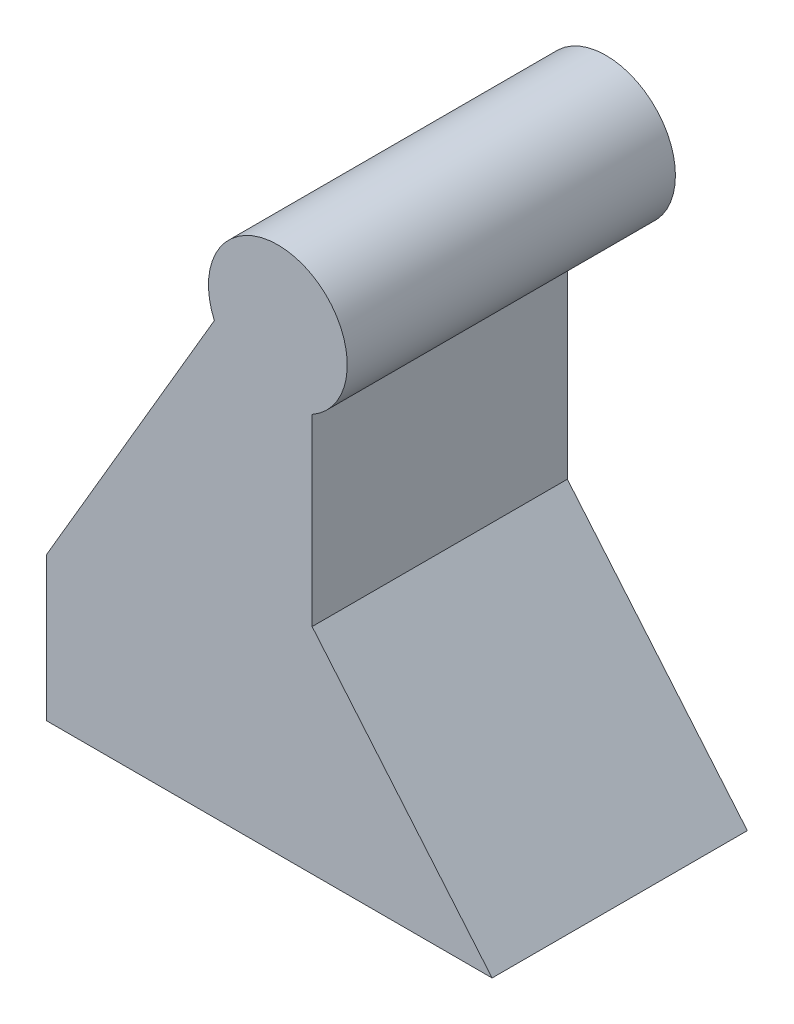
from build123d import *

# Parameters (mm, degrees)
EXTRUDE1_DEPTH      = 10
EXTRUDE1_DEPTH_BACK = 10
SKETCH1_R           = 9.516746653
SKETCH1_R_2         = 4.309736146
EXTRUDE2_DEPTH      = 25
EXTRUDE2_DEPTH_BACK = 10
EXTRUDE3_DEPTH      = 25


with BuildPart() as part:
    # Sketch1 → Extrude1 (new, two sides: drawn at the far end of the back side and taken through both)
    with BuildSketch(Plane.XY.offset(-EXTRUDE1_DEPTH_BACK)):
        with Locations((-74.315769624, -7.949999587)):
            Circle(SKETCH1_R)
        with Locations((-74.315769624, -7.949999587)):
            Circle(SKETCH1_R_2, mode=Mode.SUBTRACT)
    extrude(amount=EXTRUDE1_DEPTH + EXTRUDE1_DEPTH_BACK)

    # Sketch2 → Extrude2 (add, two sides: drawn at the far end of the back side and taken through both)
    with BuildSketch(Plane.XY.offset(10).offset(-EXTRUDE2_DEPTH_BACK)):
        with BuildLine():
            Line((-83.025654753, -11.784887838), (-106.019653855, -51.047339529))
            Line((-106.019653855, -51.047339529), (-106.019653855, -70.815363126))
            Line((-106.019653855, -70.815363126), (-44.938455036, -70.815363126))
            Line((-44.938455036, -70.815363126), (-69.620440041, -41.423398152))
            Line((-69.620440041, -41.423398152), (-69.620440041, -16.227822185))
            ThreePointArc((-69.620440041, -16.227822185), (-77.309777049, -16.983514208), (-83.025654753, -11.784887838))
        make_face()
    extrude(amount=EXTRUDE2_DEPTH + EXTRUDE2_DEPTH_BACK)

    # Sketch3 → Extrude3 (add)
    with BuildSketch(Plane.XY.offset(10)):
        with BuildLine():
            ThreePointArc((-83.025654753, -11.784887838), (-77.309777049, -16.983514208), (-69.620440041, -16.227822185))
            ThreePointArc((-69.620440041, -16.227822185), (-71.321762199, 1.083515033), (-83.025654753, -11.784887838))
        make_face()
    extrude(amount=EXTRUDE3_DEPTH)


solid = part.part
